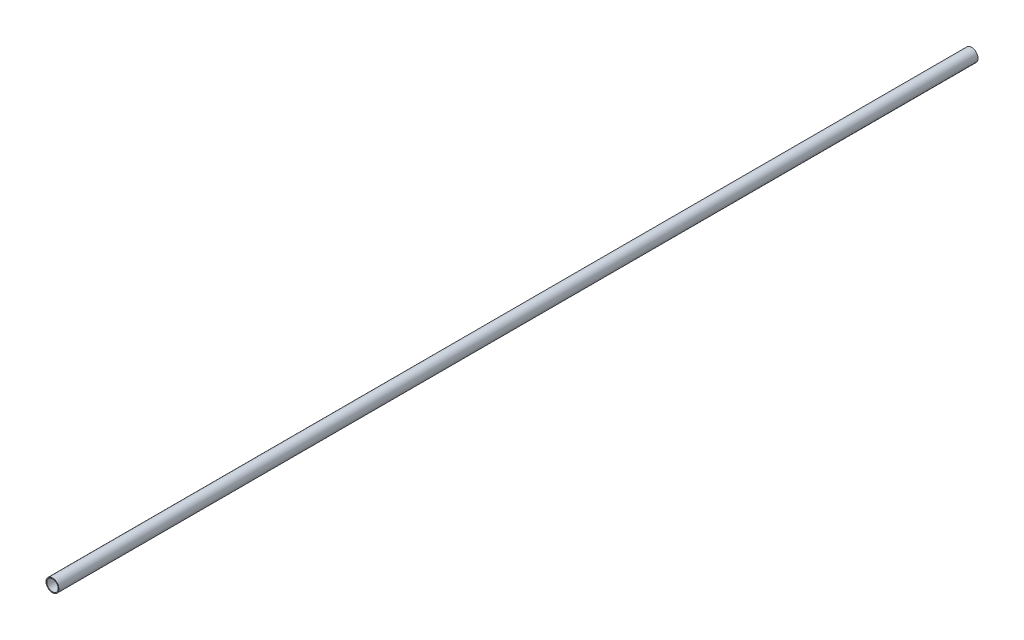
ISO-10303-21;
HEADER;
FILE_DESCRIPTION(('STEP AP214'),'2;1');
FILE_NAME('part.step','',(''),(''),'','','');
FILE_SCHEMA(('AUTOMOTIVE_DESIGN { 1 0 10303 214 1 1 1 1 }'));
ENDSEC;
DATA;
#1=APPLICATION_CONTEXT('core data for automotive mechanical design processes');
#2=APPLICATION_PROTOCOL_DEFINITION('international standard','automotive_design',2000,#1);
#3=PRODUCT_CONTEXT('',#1,'mechanical');
#4=PRODUCT('Part','Part','',(#3));
#5=PRODUCT_RELATED_PRODUCT_CATEGORY('part','',(#4));
#6=PRODUCT_DEFINITION_FORMATION('','',#4);
#7=PRODUCT_DEFINITION_CONTEXT('part definition',#1,'design');
#8=PRODUCT_DEFINITION('design','',#6,#7);
#9=PRODUCT_DEFINITION_SHAPE('','',#8);
#10=(LENGTH_UNIT() NAMED_UNIT(*) SI_UNIT(.MILLI.,.METRE.));
#11=(NAMED_UNIT(*) PLANE_ANGLE_UNIT() SI_UNIT($,.RADIAN.));
#12=(NAMED_UNIT(*) SI_UNIT($,.STERADIAN.) SOLID_ANGLE_UNIT());
#13=UNCERTAINTY_MEASURE_WITH_UNIT(LENGTH_MEASURE(1.E-05),#10,'distance_accuracy_value','');
#14=(GEOMETRIC_REPRESENTATION_CONTEXT(3) GLOBAL_UNCERTAINTY_ASSIGNED_CONTEXT((#13)) GLOBAL_UNIT_ASSIGNED_CONTEXT((#10,
#11,#12)) REPRESENTATION_CONTEXT('',''));
#15=CARTESIAN_POINT('',(0.,0.,0.));
#16=DIRECTION('',(0.,0.,1.));
#17=DIRECTION('',(1.,0.,0.));
#18=AXIS2_PLACEMENT_3D('',#15,#16,#17);
#19=CARTESIAN_POINT('',(0.,0.,57.));
#20=DIRECTION('',(0.,0.,1.));
#21=DIRECTION('',(1.,0.,0.));
#22=AXIS2_PLACEMENT_3D('',#19,#20,#21);
#23=PLANE('',#22);
#24=CARTESIAN_POINT('',(0.,0.,57.));
#25=DIRECTION('',(0.,0.,1.));
#26=DIRECTION('',(1.,0.,0.));
#27=AXIS2_PLACEMENT_3D('',#24,#25,#26);
#28=CIRCLE('',#27,0.4);
#29=CARTESIAN_POINT('',(0.4,0.,57.));
#30=VERTEX_POINT('',#29);
#31=EDGE_CURVE('E10',#30,#30,#28,.T.);
#32=ORIENTED_EDGE('',*,*,#31,.T.);
#33=EDGE_LOOP('',(#32));
#34=FACE_BOUND('',#33,.T.);
#35=CARTESIAN_POINT('',(0.,0.,57.));
#36=DIRECTION('',(0.,0.,1.));
#37=DIRECTION('',(1.,0.,0.));
#38=AXIS2_PLACEMENT_3D('',#35,#36,#37);
#39=CIRCLE('',#38,0.35);
#40=CARTESIAN_POINT('',(0.35,0.,57.));
#41=VERTEX_POINT('',#40);
#42=EDGE_CURVE('E39',#41,#41,#39,.T.);
#43=ORIENTED_EDGE('',*,*,#42,.F.);
#44=EDGE_LOOP('',(#43));
#45=FACE_BOUND('',#44,.T.);
#46=ADVANCED_FACE('F28',(#34,#45),#23,.T.);
#47=CARTESIAN_POINT('',(0.,0.,0.));
#48=DIRECTION('',(0.,0.,1.));
#49=DIRECTION('',(1.,0.,0.));
#50=AXIS2_PLACEMENT_3D('',#47,#48,#49);
#51=PLANE('',#50);
#52=CARTESIAN_POINT('',(0.,0.,0.));
#53=DIRECTION('',(0.,0.,1.));
#54=DIRECTION('',(1.,0.,0.));
#55=AXIS2_PLACEMENT_3D('',#52,#53,#54);
#56=CIRCLE('',#55,0.4);
#57=CARTESIAN_POINT('',(0.4,0.,0.));
#58=VERTEX_POINT('',#57);
#59=EDGE_CURVE('E32',#58,#58,#56,.T.);
#60=ORIENTED_EDGE('',*,*,#59,.F.);
#61=EDGE_LOOP('',(#60));
#62=FACE_BOUND('',#61,.T.);
#63=CARTESIAN_POINT('',(0.,0.,0.));
#64=DIRECTION('',(0.,0.,1.));
#65=DIRECTION('',(1.,0.,0.));
#66=AXIS2_PLACEMENT_3D('',#63,#64,#65);
#67=CIRCLE('',#66,0.35);
#68=CARTESIAN_POINT('',(0.35,0.,0.));
#69=VERTEX_POINT('',#68);
#70=EDGE_CURVE('E41',#69,#69,#67,.T.);
#71=ORIENTED_EDGE('',*,*,#70,.T.);
#72=EDGE_LOOP('',(#71));
#73=FACE_BOUND('',#72,.T.);
#74=ADVANCED_FACE('F51',(#62,#73),#51,.F.);
#75=CARTESIAN_POINT('',(0.,0.,57.));
#76=DIRECTION('',(0.,0.,-1.));
#77=DIRECTION('',(-1.,0.,0.));
#78=AXIS2_PLACEMENT_3D('',#75,#76,#77);
#79=CYLINDRICAL_SURFACE('',#78,0.4);
#80=ORIENTED_EDGE('',*,*,#31,.F.);
#81=EDGE_LOOP('',(#80));
#82=FACE_BOUND('',#81,.T.);
#83=ORIENTED_EDGE('',*,*,#59,.T.);
#84=EDGE_LOOP('',(#83));
#85=FACE_BOUND('',#84,.T.);
#86=ADVANCED_FACE('F30',(#82,#85),#79,.T.);
#87=CARTESIAN_POINT('',(0.,0.,57.));
#88=DIRECTION('',(0.,0.,-1.));
#89=DIRECTION('',(-1.,0.,0.));
#90=AXIS2_PLACEMENT_3D('',#87,#88,#89);
#91=CYLINDRICAL_SURFACE('',#90,0.35);
#92=ORIENTED_EDGE('',*,*,#42,.T.);
#93=EDGE_LOOP('',(#92));
#94=FACE_BOUND('',#93,.T.);
#95=ORIENTED_EDGE('',*,*,#70,.F.);
#96=EDGE_LOOP('',(#95));
#97=FACE_BOUND('',#96,.T.);
#98=ADVANCED_FACE('F47',(#94,#97),#91,.F.);
#99=CLOSED_SHELL('',(#46,#74,#86,#98));
#100=MANIFOLD_SOLID_BREP('B2',#99);
#101=ADVANCED_BREP_SHAPE_REPRESENTATION('',(#18,#100),#14);
#102=SHAPE_DEFINITION_REPRESENTATION(#9,#101);
ENDSEC;
END-ISO-10303-21;
